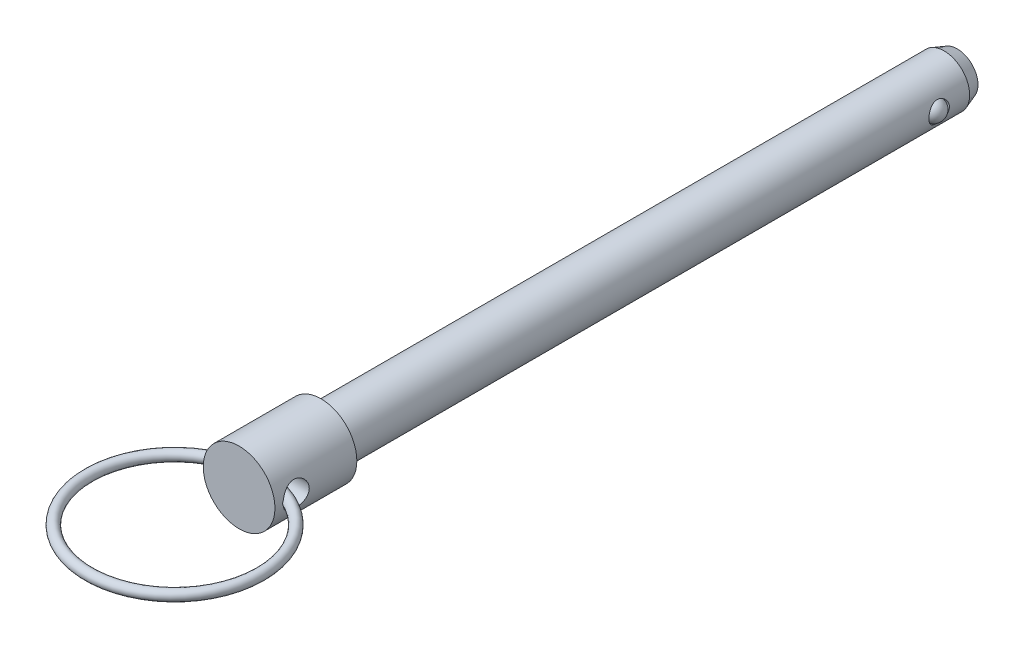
ISO-10303-21;
HEADER;
FILE_DESCRIPTION(('STEP AP214'),'2;1');
FILE_NAME('part.step','',(''),(''),'','','');
FILE_SCHEMA(('AUTOMOTIVE_DESIGN { 1 0 10303 214 1 1 1 1 }'));
ENDSEC;
DATA;
#1=APPLICATION_CONTEXT('core data for automotive mechanical design processes');
#2=APPLICATION_PROTOCOL_DEFINITION('international standard','automotive_design',2000,#1);
#3=PRODUCT_CONTEXT('',#1,'mechanical');
#4=PRODUCT('Part','Part','',(#3));
#5=PRODUCT_RELATED_PRODUCT_CATEGORY('part','',(#4));
#6=PRODUCT_DEFINITION_FORMATION('','',#4);
#7=PRODUCT_DEFINITION_CONTEXT('part definition',#1,'design');
#8=PRODUCT_DEFINITION('design','',#6,#7);
#9=PRODUCT_DEFINITION_SHAPE('','',#8);
#10=(LENGTH_UNIT() NAMED_UNIT(*) SI_UNIT(.MILLI.,.METRE.));
#11=(NAMED_UNIT(*) PLANE_ANGLE_UNIT() SI_UNIT($,.RADIAN.));
#12=(NAMED_UNIT(*) SI_UNIT($,.STERADIAN.) SOLID_ANGLE_UNIT());
#13=UNCERTAINTY_MEASURE_WITH_UNIT(LENGTH_MEASURE(1.E-05),#10,'distance_accuracy_value','');
#14=(GEOMETRIC_REPRESENTATION_CONTEXT(3) GLOBAL_UNCERTAINTY_ASSIGNED_CONTEXT((#13)) GLOBAL_UNIT_ASSIGNED_CONTEXT((#10,
#11,#12)) REPRESENTATION_CONTEXT('',''));
#15=CARTESIAN_POINT('',(0.,0.,0.));
#16=DIRECTION('',(0.,0.,1.));
#17=DIRECTION('',(1.,0.,0.));
#18=AXIS2_PLACEMENT_3D('',#15,#16,#17);
#19=CARTESIAN_POINT('',(7.9375,0.,9.398));
#20=DIRECTION('',(-1.,0.,0.));
#21=DIRECTION('',(0.,0.,-1.));
#22=AXIS2_PLACEMENT_3D('',#19,#20,#21);
#23=CYLINDRICAL_SURFACE('',#22,2.0193);
#24=CARTESIAN_POINT('',(-5.55645,0.413388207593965,11.3745329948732));
#25=CARTESIAN_POINT('',(-5.53323669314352,0.388835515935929,11.3796705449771));
#26=CARTESIAN_POINT('',(-5.51157389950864,0.362641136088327,11.3846690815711));
#27=CARTESIAN_POINT('',(-5.47216390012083,0.307044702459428,11.3940198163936));
#28=CARTESIAN_POINT('',(-5.45444977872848,0.277618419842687,11.3983664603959));
#29=CARTESIAN_POINT('',(-5.42406600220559,0.215851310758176,11.4059720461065));
#30=CARTESIAN_POINT('',(-5.41142802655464,0.183493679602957,11.4092241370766));
#31=CARTESIAN_POINT('',(-5.3923512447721,0.116986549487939,11.4141821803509));
#32=CARTESIAN_POINT('',(-5.38588919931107,0.0828442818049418,11.4158939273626));
#33=CARTESIAN_POINT('',(-5.3799561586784,0.0172985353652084,11.4174656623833));
#34=CARTESIAN_POINT('',(-5.37986165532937,-0.0140451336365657,11.4174908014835));
#35=CARTESIAN_POINT('',(-5.38511249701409,-0.0762532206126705,11.4160995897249));
#36=CARTESIAN_POINT('',(-5.39046041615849,-0.10711740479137,11.4146825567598));
#37=CARTESIAN_POINT('',(-5.40574321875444,-0.16564025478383,11.4106965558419));
#38=CARTESIAN_POINT('',(-5.41539031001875,-0.19338072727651,11.408200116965));
#39=CARTESIAN_POINT('',(-5.43862859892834,-0.247073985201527,11.4023097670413));
#40=CARTESIAN_POINT('',(-5.45222392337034,-0.27302486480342,11.398914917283));
#41=CARTESIAN_POINT('',(-5.48024922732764,-0.318737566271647,11.3920973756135));
#42=CARTESIAN_POINT('',(-5.49418727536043,-0.33882099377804,11.3887682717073));
#43=CARTESIAN_POINT('',(-5.523970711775,-0.37733037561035,11.3818282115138));
#44=CARTESIAN_POINT('',(-5.53980753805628,-0.395763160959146,11.378218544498));
#45=CARTESIAN_POINT('',(-5.55645,-0.413388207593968,11.3745329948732));
#46=B_SPLINE_CURVE_WITH_KNOTS('',3,(#24,#25,#26,#27,#28,#29,#30,#31,#32,#33,#34,#35,#36,#37,#38,
#39,#40,#41,#42,#43,#44,#45),.UNSPECIFIED.,.F.,.F.,(4,2,2,2,2,2,2,2,2,2,4),(0.,
0.102621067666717,0.206072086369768,0.310159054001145,0.413852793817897,0.507376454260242,
0.600944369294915,0.689017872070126,0.777183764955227,0.851068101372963,0.924630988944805),.UNSPECIFIED.);
#47=CARTESIAN_POINT('',(-5.54200209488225,0.397651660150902,11.3777589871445));
#48=VERTEX_POINT('',#47);
#49=CARTESIAN_POINT('',(-5.5420020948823,-0.397651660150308,11.3777589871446));
#50=VERTEX_POINT('',#49);
#51=EDGE_CURVE('E40',#48,#50,#46,.T.);
#52=ORIENTED_EDGE('',*,*,#51,.F.);
#53=CARTESIAN_POINT('',(-5.55625,0.,11.4173));
#54=CARTESIAN_POINT('',(-5.55624527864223,-0.109432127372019,11.4172937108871));
#55=CARTESIAN_POINT('',(-5.55298237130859,-0.218969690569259,11.408361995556));
#56=CARTESIAN_POINT('',(-5.54026368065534,-0.434902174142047,11.372953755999));
#57=CARTESIAN_POINT('',(-5.53079819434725,-0.54129189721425,11.3464497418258));
#58=CARTESIAN_POINT('',(-5.50670156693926,-0.747605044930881,11.2769560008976));
#59=CARTESIAN_POINT('',(-5.49208344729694,-0.847544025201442,11.2340078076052));
#60=CARTESIAN_POINT('',(-5.45915039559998,-1.03875753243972,11.1330083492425));
#61=CARTESIAN_POINT('',(-5.44083572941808,-1.13003268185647,11.0749581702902));
#62=CARTESIAN_POINT('',(-5.4015811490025,-1.30505728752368,10.9429422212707));
#63=CARTESIAN_POINT('',(-5.38056990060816,-1.38841141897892,10.8684736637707));
#64=CARTESIAN_POINT('',(-5.33865236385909,-1.54176439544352,10.7067995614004));
#65=CARTESIAN_POINT('',(-5.31774611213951,-1.61175885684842,10.6195898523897));
#66=CARTESIAN_POINT('',(-5.27759352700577,-1.73882919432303,10.4311528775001));
#67=CARTESIAN_POINT('',(-5.25843183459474,-1.79536185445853,10.3295394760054));
#68=CARTESIAN_POINT('',(-5.22503611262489,-1.89036141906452,10.1174402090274));
#69=CARTESIAN_POINT('',(-5.21080023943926,-1.92883508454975,10.0069576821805));
#70=CARTESIAN_POINT('',(-5.18962447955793,-1.98509166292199,9.78477737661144));
#71=CARTESIAN_POINT('',(-5.18242178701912,-2.00362275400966,9.67329490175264));
#72=CARTESIAN_POINT('',(-5.17535625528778,-2.02180769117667,9.44858805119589));
#73=CARTESIAN_POINT('',(-5.17549061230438,-2.02146874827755,9.33536435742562));
#74=CARTESIAN_POINT('',(-5.18285629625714,-2.00249790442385,9.11709454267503));
#75=CARTESIAN_POINT('',(-5.18969215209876,-1.98488533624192,9.01194405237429));
#76=CARTESIAN_POINT('',(-5.20903632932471,-1.93354575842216,8.80620743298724));
#77=CARTESIAN_POINT('',(-5.22154547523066,-1.89981640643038,8.70562196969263));
#78=CARTESIAN_POINT('',(-5.25107746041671,-1.81661001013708,8.50972358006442));
#79=CARTESIAN_POINT('',(-5.26817827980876,-1.76685762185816,8.41453987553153));
#80=CARTESIAN_POINT('',(-5.30493780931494,-1.65321144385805,8.23357336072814));
#81=CARTESIAN_POINT('',(-5.32459724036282,-1.58931366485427,8.14779321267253));
#82=CARTESIAN_POINT('',(-5.36576425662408,-1.44447059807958,7.98240722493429));
#83=CARTESIAN_POINT('',(-5.38731044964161,-1.36270785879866,7.90352531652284));
#84=CARTESIAN_POINT('',(-5.42876622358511,-1.18682967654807,7.76035905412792));
#85=CARTESIAN_POINT('',(-5.44867505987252,-1.09270866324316,7.69608131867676));
#86=CARTESIAN_POINT('',(-5.48497084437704,-0.893001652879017,7.58320896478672));
#87=CARTESIAN_POINT('',(-5.5013029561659,-0.78727009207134,7.53485348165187));
#88=CARTESIAN_POINT('',(-5.52817729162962,-0.568540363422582,7.4569293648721));
#89=CARTESIAN_POINT('',(-5.53873126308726,-0.455557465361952,7.42732259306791));
#90=CARTESIAN_POINT('',(-5.54924569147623,-0.284581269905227,7.39803699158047));
#91=CARTESIAN_POINT('',(-5.55186369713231,-0.227949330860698,7.3907957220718));
#92=CARTESIAN_POINT('',(-5.55536708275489,-0.114221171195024,7.3811255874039));
#93=CARTESIAN_POINT('',(-5.55625246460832,-0.0571249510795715,7.37869671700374));
#94=CARTESIAN_POINT('',(-5.55624527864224,0.109432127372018,7.37870628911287));
#95=CARTESIAN_POINT('',(-5.55298237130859,0.218969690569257,7.38763800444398));
#96=CARTESIAN_POINT('',(-5.54026368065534,0.434902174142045,7.42304624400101));
#97=CARTESIAN_POINT('',(-5.53079819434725,0.541291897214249,7.44955025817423));
#98=CARTESIAN_POINT('',(-5.50670156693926,0.747605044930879,7.51904399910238));
#99=CARTESIAN_POINT('',(-5.49208344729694,0.847544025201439,7.56199219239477));
#100=CARTESIAN_POINT('',(-5.45915039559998,1.03875753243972,7.66299165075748));
#101=CARTESIAN_POINT('',(-5.44083572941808,1.13003268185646,7.72104182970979));
#102=CARTESIAN_POINT('',(-5.4015811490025,1.30505728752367,7.85305777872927));
#103=CARTESIAN_POINT('',(-5.38056990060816,1.38841141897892,7.92752633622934));
#104=CARTESIAN_POINT('',(-5.33865236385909,1.54176439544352,8.08920043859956));
#105=CARTESIAN_POINT('',(-5.31774611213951,1.61175885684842,8.17641014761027));
#106=CARTESIAN_POINT('',(-5.27759352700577,1.73882919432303,8.36484712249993));
#107=CARTESIAN_POINT('',(-5.25843183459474,1.79536185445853,8.46646052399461));
#108=CARTESIAN_POINT('',(-5.22503611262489,1.89036141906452,8.67855979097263));
#109=CARTESIAN_POINT('',(-5.21080023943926,1.92883508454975,8.78904231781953));
#110=CARTESIAN_POINT('',(-5.18962447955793,1.98509166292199,9.01122262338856));
#111=CARTESIAN_POINT('',(-5.18242178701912,2.00362275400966,9.12270509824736));
#112=CARTESIAN_POINT('',(-5.17535625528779,2.02180769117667,9.34741194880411));
#113=CARTESIAN_POINT('',(-5.17549061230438,2.02146874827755,9.46063564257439));
#114=CARTESIAN_POINT('',(-5.18285629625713,2.00249790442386,9.67890545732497));
#115=CARTESIAN_POINT('',(-5.18969215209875,1.98488533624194,9.78405594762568));
#116=CARTESIAN_POINT('',(-5.20903632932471,1.93354575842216,9.98979256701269));
#117=CARTESIAN_POINT('',(-5.22154547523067,1.89981640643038,10.0903780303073));
#118=CARTESIAN_POINT('',(-5.25107746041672,1.81661001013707,10.2862764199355));
#119=CARTESIAN_POINT('',(-5.26817827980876,1.76685762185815,10.3814601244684));
#120=CARTESIAN_POINT('',(-5.30493780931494,1.65321144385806,10.5624266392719));
#121=CARTESIAN_POINT('',(-5.32459724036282,1.58931366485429,10.6482067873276));
#122=CARTESIAN_POINT('',(-5.36576425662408,1.44447059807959,10.8135927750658));
#123=CARTESIAN_POINT('',(-5.38731044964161,1.36270785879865,10.8924746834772));
#124=CARTESIAN_POINT('',(-5.42876622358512,1.18682967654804,11.0356409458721));
#125=CARTESIAN_POINT('',(-5.44867505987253,1.09270866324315,11.0999186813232));
#126=CARTESIAN_POINT('',(-5.48497084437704,0.893001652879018,11.2127910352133));
#127=CARTESIAN_POINT('',(-5.5013029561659,0.787270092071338,11.2611465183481));
#128=CARTESIAN_POINT('',(-5.52817729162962,0.56854036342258,11.3390706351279));
#129=CARTESIAN_POINT('',(-5.53873126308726,0.455557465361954,11.3686774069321));
#130=CARTESIAN_POINT('',(-5.54924569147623,0.28458126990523,11.3979630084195));
#131=CARTESIAN_POINT('',(-5.55186369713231,0.2279493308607,11.4052042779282));
#132=CARTESIAN_POINT('',(-5.5553670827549,0.114221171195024,11.4148744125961));
#133=CARTESIAN_POINT('',(-5.55625246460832,0.057124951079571,11.4173032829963));
#134=CARTESIAN_POINT('',(-5.55625,0.,11.4173));
#135=B_SPLINE_CURVE_WITH_KNOTS('',3,(#53,#54,#55,#56,#57,#58,#59,#60,#61,#62,#63,#64,#65,#66,
#67,#68,#69,#70,#71,#72,#73,#74,#75,#76,#77,#78,#79,#80,#81,#82,#83,#84,#85,#86,#87,#88,#89,#90,
#91,#92,#93,#94,#95,#96,#97,#98,#99,#100,#101,#102,#103,#104,#105,#106,#107,#108,#109,#110,#111,
#112,#113,#114,#115,#116,#117,#118,#119,#120,#121,#122,#123,#124,#125,#126,#127,#128,#129,#130,
#131,#132,#133,#134),.UNSPECIFIED.,.T.,.F.,(4,2,2,2,2,2,2,2,2,2,2,2,2,2,2,2,2,2,2,2,2,2,2,2,2,2,
2,2,2,2,2,2,2,2,2,2,2,2,2,2,4),(0.,0.328075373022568,0.656665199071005,0.984430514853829,
1.31217226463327,1.65185430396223,1.99164760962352,2.3434350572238,2.69509069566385,
3.03303658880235,3.3708533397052,3.68986542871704,4.00892389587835,4.33378721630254,
4.65874227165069,5.00406386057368,5.34954163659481,5.69999369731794,6.04973056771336,
6.22099023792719,6.39224972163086,6.72032509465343,7.04891492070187,7.37668023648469,
7.70442198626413,8.04410402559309,8.38389733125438,8.73568477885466,9.08734041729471,
9.42528631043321,9.76310306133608,10.0821151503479,10.4011736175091,10.7260369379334,
11.0509919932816,11.3963135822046,11.7417913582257,12.0922434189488,12.4419802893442,
12.6132399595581,12.7844994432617),.UNSPECIFIED.);
#136=EDGE_CURVE('E66',#50,#48,#135,.T.);
#137=ORIENTED_EDGE('',*,*,#136,.F.);
#138=EDGE_LOOP('',(#52,#137));
#139=FACE_BOUND('',#138,.T.);
#140=CARTESIAN_POINT('',(5.55645,-0.41338820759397,11.3745329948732));
#141=CARTESIAN_POINT('',(5.53323669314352,-0.388835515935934,11.3796705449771));
#142=CARTESIAN_POINT('',(5.51157389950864,-0.362641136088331,11.3846690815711));
#143=CARTESIAN_POINT('',(5.47216390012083,-0.307044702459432,11.3940198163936));
#144=CARTESIAN_POINT('',(5.45444977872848,-0.277618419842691,11.3983664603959));
#145=CARTESIAN_POINT('',(5.42406600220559,-0.215851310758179,11.4059720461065));
#146=CARTESIAN_POINT('',(5.41142802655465,-0.183493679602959,11.4092241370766));
#147=CARTESIAN_POINT('',(5.3923512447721,-0.116986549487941,11.4141821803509));
#148=CARTESIAN_POINT('',(5.38588919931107,-0.0828442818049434,11.4158939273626));
#149=CARTESIAN_POINT('',(5.3799561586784,-0.0172985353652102,11.4174656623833));
#150=CARTESIAN_POINT('',(5.37986165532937,0.0140451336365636,11.4174908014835));
#151=CARTESIAN_POINT('',(5.38511249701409,0.0762532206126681,11.4160995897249));
#152=CARTESIAN_POINT('',(5.39046041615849,0.107117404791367,11.4146825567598));
#153=CARTESIAN_POINT('',(5.40574321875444,0.165640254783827,11.4106965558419));
#154=CARTESIAN_POINT('',(5.41539031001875,0.193380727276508,11.408200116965));
#155=CARTESIAN_POINT('',(5.43862859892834,0.247073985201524,11.4023097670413));
#156=CARTESIAN_POINT('',(5.45222392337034,0.273024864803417,11.398914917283));
#157=CARTESIAN_POINT('',(5.48024922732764,0.318737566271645,11.3920973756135));
#158=CARTESIAN_POINT('',(5.49418727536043,0.338820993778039,11.3887682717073));
#159=CARTESIAN_POINT('',(5.523970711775,0.37733037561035,11.3818282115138));
#160=CARTESIAN_POINT('',(5.53980753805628,0.395763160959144,11.378218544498));
#161=CARTESIAN_POINT('',(5.55645,0.413388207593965,11.3745329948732));
#162=B_SPLINE_CURVE_WITH_KNOTS('',3,(#140,#141,#142,#143,#144,#145,#146,#147,#148,#149,#150,
#151,#152,#153,#154,#155,#156,#157,#158,#159,#160,#161),.UNSPECIFIED.,.F.,.F.,(4,2,2,2,2,2,2,2,
2,2,4),(0.,0.102621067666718,0.206072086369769,0.310159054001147,0.4138527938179,
0.507376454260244,0.600944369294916,0.689017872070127,0.777183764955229,0.851068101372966,
0.924630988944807),.UNSPECIFIED.);
#163=CARTESIAN_POINT('',(5.54200209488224,-0.397651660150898,11.3777589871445));
#164=VERTEX_POINT('',#163);
#165=CARTESIAN_POINT('',(5.54200209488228,0.397651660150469,11.3777589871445));
#166=VERTEX_POINT('',#165);
#167=EDGE_CURVE('E33',#164,#166,#162,.T.);
#168=ORIENTED_EDGE('',*,*,#167,.F.);
#169=CARTESIAN_POINT('',(5.55625,0.,7.3787));
#170=CARTESIAN_POINT('',(5.55624527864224,-0.109432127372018,7.37870628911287));
#171=CARTESIAN_POINT('',(5.55298237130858,-0.218969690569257,7.38763800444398));
#172=CARTESIAN_POINT('',(5.54026368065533,-0.434902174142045,7.42304624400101));
#173=CARTESIAN_POINT('',(5.53079819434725,-0.541291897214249,7.44955025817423));
#174=CARTESIAN_POINT('',(5.50670156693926,-0.747605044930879,7.51904399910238));
#175=CARTESIAN_POINT('',(5.49208344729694,-0.847544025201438,7.56199219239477));
#176=CARTESIAN_POINT('',(5.45915039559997,-1.03875753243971,7.66299165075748));
#177=CARTESIAN_POINT('',(5.44083572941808,-1.13003268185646,7.72104182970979));
#178=CARTESIAN_POINT('',(5.4015811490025,-1.30505728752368,7.85305777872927));
#179=CARTESIAN_POINT('',(5.38056990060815,-1.38841141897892,7.92752633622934));
#180=CARTESIAN_POINT('',(5.33865236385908,-1.54176439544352,8.08920043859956));
#181=CARTESIAN_POINT('',(5.31774611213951,-1.61175885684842,8.17641014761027));
#182=CARTESIAN_POINT('',(5.27759352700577,-1.73882919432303,8.36484712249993));
#183=CARTESIAN_POINT('',(5.25843183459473,-1.79536185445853,8.46646052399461));
#184=CARTESIAN_POINT('',(5.22503611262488,-1.89036141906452,8.67855979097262));
#185=CARTESIAN_POINT('',(5.21080023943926,-1.92883508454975,8.78904231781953));
#186=CARTESIAN_POINT('',(5.18962447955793,-1.98509166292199,9.01122262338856));
#187=CARTESIAN_POINT('',(5.18242178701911,-2.00362275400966,9.12270509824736));
#188=CARTESIAN_POINT('',(5.17535625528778,-2.02180769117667,9.34741194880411));
#189=CARTESIAN_POINT('',(5.17549061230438,-2.02146874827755,9.46063564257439));
#190=CARTESIAN_POINT('',(5.18285629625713,-2.00249790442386,9.67890545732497));
#191=CARTESIAN_POINT('',(5.18969215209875,-1.98488533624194,9.78405594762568));
#192=CARTESIAN_POINT('',(5.2090363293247,-1.93354575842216,9.98979256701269));
#193=CARTESIAN_POINT('',(5.22154547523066,-1.89981640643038,10.0903780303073));
#194=CARTESIAN_POINT('',(5.25107746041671,-1.81661001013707,10.2862764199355));
#195=CARTESIAN_POINT('',(5.26817827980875,-1.76685762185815,10.3814601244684));
#196=CARTESIAN_POINT('',(5.30493780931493,-1.65321144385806,10.5624266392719));
#197=CARTESIAN_POINT('',(5.32459724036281,-1.58931366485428,10.6482067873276));
#198=CARTESIAN_POINT('',(5.36576425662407,-1.44447059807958,10.8135927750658));
#199=CARTESIAN_POINT('',(5.3873104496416,-1.36270785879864,10.8924746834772));
#200=CARTESIAN_POINT('',(5.42876622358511,-1.18682967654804,11.0356409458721));
#201=CARTESIAN_POINT('',(5.44867505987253,-1.09270866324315,11.0999186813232));
#202=CARTESIAN_POINT('',(5.48497084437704,-0.893001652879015,11.2127910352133));
#203=CARTESIAN_POINT('',(5.50130295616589,-0.787270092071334,11.2611465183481));
#204=CARTESIAN_POINT('',(5.52817729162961,-0.568540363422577,11.3390706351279));
#205=CARTESIAN_POINT('',(5.53873126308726,-0.455557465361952,11.3686774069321));
#206=CARTESIAN_POINT('',(5.54924569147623,-0.284581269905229,11.3979630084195));
#207=CARTESIAN_POINT('',(5.5518636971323,-0.227949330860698,11.4052042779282));
#208=CARTESIAN_POINT('',(5.55536708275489,-0.114221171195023,11.4148744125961));
#209=CARTESIAN_POINT('',(5.55625246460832,-0.0571249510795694,11.4173032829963));
#210=CARTESIAN_POINT('',(5.55624527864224,0.10943212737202,11.4172937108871));
#211=CARTESIAN_POINT('',(5.55298237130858,0.21896969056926,11.408361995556));
#212=CARTESIAN_POINT('',(5.54026368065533,0.434902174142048,11.372953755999));
#213=CARTESIAN_POINT('',(5.53079819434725,0.541291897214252,11.3464497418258));
#214=CARTESIAN_POINT('',(5.50670156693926,0.74760504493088,11.2769560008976));
#215=CARTESIAN_POINT('',(5.49208344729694,0.847544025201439,11.2340078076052));
#216=CARTESIAN_POINT('',(5.45915039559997,1.03875753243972,11.1330083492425));
#217=CARTESIAN_POINT('',(5.44083572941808,1.13003268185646,11.0749581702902));
#218=CARTESIAN_POINT('',(5.4015811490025,1.30505728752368,10.9429422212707));
#219=CARTESIAN_POINT('',(5.38056990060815,1.38841141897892,10.8684736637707));
#220=CARTESIAN_POINT('',(5.33865236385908,1.54176439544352,10.7067995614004));
#221=CARTESIAN_POINT('',(5.31774611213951,1.61175885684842,10.6195898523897));
#222=CARTESIAN_POINT('',(5.27759352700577,1.73882919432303,10.4311528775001));
#223=CARTESIAN_POINT('',(5.25843183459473,1.79536185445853,10.3295394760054));
#224=CARTESIAN_POINT('',(5.22503611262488,1.89036141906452,10.1174402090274));
#225=CARTESIAN_POINT('',(5.21080023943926,1.92883508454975,10.0069576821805));
#226=CARTESIAN_POINT('',(5.18962447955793,1.98509166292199,9.78477737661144));
#227=CARTESIAN_POINT('',(5.18242178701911,2.00362275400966,9.67329490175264));
#228=CARTESIAN_POINT('',(5.17535625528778,2.02180769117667,9.44858805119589));
#229=CARTESIAN_POINT('',(5.17549061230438,2.02146874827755,9.33536435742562));
#230=CARTESIAN_POINT('',(5.18285629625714,2.00249790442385,9.11709454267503));
#231=CARTESIAN_POINT('',(5.18969215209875,1.98488533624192,9.01194405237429));
#232=CARTESIAN_POINT('',(5.2090363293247,1.93354575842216,8.80620743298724));
#233=CARTESIAN_POINT('',(5.22154547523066,1.89981640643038,8.70562196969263));
#234=CARTESIAN_POINT('',(5.25107746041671,1.81661001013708,8.50972358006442));
#235=CARTESIAN_POINT('',(5.26817827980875,1.76685762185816,8.41453987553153));
#236=CARTESIAN_POINT('',(5.30493780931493,1.65321144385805,8.23357336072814));
#237=CARTESIAN_POINT('',(5.32459724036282,1.58931366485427,8.14779321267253));
#238=CARTESIAN_POINT('',(5.36576425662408,1.44447059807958,7.98240722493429));
#239=CARTESIAN_POINT('',(5.3873104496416,1.36270785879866,7.90352531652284));
#240=CARTESIAN_POINT('',(5.4287662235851,1.18682967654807,7.76035905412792));
#241=CARTESIAN_POINT('',(5.44867505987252,1.09270866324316,7.69608131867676));
#242=CARTESIAN_POINT('',(5.48497084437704,0.893001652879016,7.58320896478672));
#243=CARTESIAN_POINT('',(5.50130295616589,0.787270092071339,7.53485348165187));
#244=CARTESIAN_POINT('',(5.52817729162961,0.56854036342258,7.4569293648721));
#245=CARTESIAN_POINT('',(5.53873126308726,0.455557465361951,7.42732259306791));
#246=CARTESIAN_POINT('',(5.54924569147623,0.284581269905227,7.39803699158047));
#247=CARTESIAN_POINT('',(5.5518636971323,0.227949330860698,7.3907957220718));
#248=CARTESIAN_POINT('',(5.55536708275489,0.114221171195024,7.3811255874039));
#249=CARTESIAN_POINT('',(5.55625246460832,0.0571249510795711,7.37869671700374));
#250=CARTESIAN_POINT('',(5.55625,0.,7.3787));
#251=B_SPLINE_CURVE_WITH_KNOTS('',3,(#169,#170,#171,#172,#173,#174,#175,#176,#177,#178,#179,
#180,#181,#182,#183,#184,#185,#186,#187,#188,#189,#190,#191,#192,#193,#194,#195,#196,#197,#198,
#199,#200,#201,#202,#203,#204,#205,#206,#207,#208,#209,#210,#211,#212,#213,#214,#215,#216,#217,
#218,#219,#220,#221,#222,#223,#224,#225,#226,#227,#228,#229,#230,#231,#232,#233,#234,#235,#236,
#237,#238,#239,#240,#241,#242,#243,#244,#245,#246,#247,#248,#249,#250),.UNSPECIFIED.,.T.,.F.,(4,
2,2,2,2,2,2,2,2,2,2,2,2,2,2,2,2,2,2,2,2,2,2,2,2,2,2,2,2,2,2,2,2,2,2,2,2,2,2,2,4),(0.,
0.328075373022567,0.656665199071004,0.984430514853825,1.31217226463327,1.65185430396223,
1.99164760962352,2.3434350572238,2.69509069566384,3.03303658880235,3.37085333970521,
3.68986542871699,4.00892389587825,4.33378721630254,4.65874227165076,5.00406386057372,
5.34954163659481,5.69999369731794,6.04973056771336,6.2209902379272,6.39224972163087,
6.72032509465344,7.04891492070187,7.37668023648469,7.70442198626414,8.0441040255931,
8.38389733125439,8.73568477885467,9.08734041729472,9.42528631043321,9.76310306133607,
10.0821151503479,10.4011736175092,10.7260369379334,11.0509919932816,11.3963135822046,
11.7417913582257,12.0922434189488,12.4419802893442,12.6132399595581,12.7844994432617),.UNSPECIFIED.);
#252=EDGE_CURVE('E62',#166,#164,#251,.T.);
#253=ORIENTED_EDGE('',*,*,#252,.F.);
#254=EDGE_LOOP('',(#168,#253));
#255=FACE_BOUND('',#254,.T.);
#256=ADVANCED_FACE('F14',(#139,#255),#23,.F.);
#257=CARTESIAN_POINT('',(0.,0.,-28.63596));
#258=DIRECTION('',(0.,0.,-1.));
#259=DIRECTION('',(1.,0.,0.));
#260=AXIS2_PLACEMENT_3D('',#257,#258,#259);
#261=CYLINDRICAL_SURFACE('',#260,5.55625);
#262=ORIENTED_EDGE('',*,*,#252,.T.);
#263=CARTESIAN_POINT('',(5.54421787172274,-0.365461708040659,9.83190663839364));
#264=CARTESIAN_POINT('',(5.54159927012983,-0.405183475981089,9.85299237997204));
#265=CARTESIAN_POINT('',(5.53866943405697,-0.443081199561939,9.87751774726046));
#266=CARTESIAN_POINT('',(5.53252642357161,-0.514143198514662,9.93266317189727));
#267=CARTESIAN_POINT('',(5.52931303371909,-0.547303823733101,9.96328788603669));
#268=CARTESIAN_POINT('',(5.52297121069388,-0.60797502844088,10.0295890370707));
#269=CARTESIAN_POINT('',(5.51984262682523,-0.635496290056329,10.0652557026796));
#270=CARTESIAN_POINT('',(5.51399436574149,-0.68438911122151,10.1405913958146));
#271=CARTESIAN_POINT('',(5.51127466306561,-0.705761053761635,10.1802601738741));
#272=CARTESIAN_POINT('',(5.50642474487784,-0.742671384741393,10.2638892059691));
#273=CARTESIAN_POINT('',(5.50431797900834,-0.757984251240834,10.3079500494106));
#274=CARTESIAN_POINT('',(5.50101204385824,-0.781615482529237,10.3979361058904));
#275=CARTESIAN_POINT('',(5.49981316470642,-0.789931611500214,10.443861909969));
#276=CARTESIAN_POINT('',(5.49835353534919,-0.800032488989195,10.539900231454));
#277=CARTESIAN_POINT('',(5.49816933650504,-0.801284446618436,10.5900697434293));
#278=CARTESIAN_POINT('',(5.49892147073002,-0.796104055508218,10.6900002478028));
#279=CARTESIAN_POINT('',(5.49985823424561,-0.789668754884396,10.7397610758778));
#280=CARTESIAN_POINT('',(5.50284107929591,-0.768620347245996,10.8417110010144));
#281=CARTESIAN_POINT('',(5.50497087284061,-0.753387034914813,10.8937702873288));
#282=CARTESIAN_POINT('',(5.51012438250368,-0.71471812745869,10.9947435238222));
#283=CARTESIAN_POINT('',(5.51314873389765,-0.691276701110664,11.0436552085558));
#284=CARTESIAN_POINT('',(5.51983464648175,-0.63572546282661,11.1383225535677));
#285=CARTESIAN_POINT('',(5.52351302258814,-0.60336997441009,11.18393381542));
#286=CARTESIAN_POINT('',(5.53095411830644,-0.530831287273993,11.2684220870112));
#287=CARTESIAN_POINT('',(5.53471671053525,-0.490659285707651,11.3073085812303));
#288=CARTESIAN_POINT('',(5.54091648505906,-0.413839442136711,11.3679116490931));
#289=CARTESIAN_POINT('',(5.54345448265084,-0.378677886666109,11.3915073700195));
#290=CARTESIAN_POINT('',(5.54800040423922,-0.304904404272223,11.4325750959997));
#291=CARTESIAN_POINT('',(5.55000873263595,-0.266295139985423,11.4500517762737));
#292=CARTESIAN_POINT('',(5.55327017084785,-0.18631270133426,11.4779870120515));
#293=CARTESIAN_POINT('',(5.55451894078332,-0.144925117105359,11.4884052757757));
#294=CARTESIAN_POINT('',(5.55607451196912,-0.0609131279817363,11.501336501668));
#295=CARTESIAN_POINT('',(5.55638174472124,-0.0182892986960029,11.5038530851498));
#296=CARTESIAN_POINT('',(5.55603111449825,0.0624826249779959,11.5009567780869));
#297=CARTESIAN_POINT('',(5.55546478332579,0.100660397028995,11.4962960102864));
#298=CARTESIAN_POINT('',(5.55359870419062,0.175681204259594,11.4806908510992));
#299=CARTESIAN_POINT('',(5.55229894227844,0.212524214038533,11.469746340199));
#300=CARTESIAN_POINT('',(5.54909692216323,0.284130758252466,11.4421008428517));
#301=CARTESIAN_POINT('',(5.5471918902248,0.318883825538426,11.4253733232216));
#302=CARTESIAN_POINT('',(5.54296322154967,0.385471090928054,11.3869302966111));
#303=CARTESIAN_POINT('',(5.54063944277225,0.417304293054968,11.3652130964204));
#304=CARTESIAN_POINT('',(5.5354829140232,0.481129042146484,11.3147874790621));
#305=CARTESIAN_POINT('',(5.53262240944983,0.512706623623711,11.2855592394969));
#306=CARTESIAN_POINT('',(5.5268796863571,0.571299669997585,11.2228494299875));
#307=CARTESIAN_POINT('',(5.52399745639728,0.598312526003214,11.1893654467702));
#308=CARTESIAN_POINT('',(5.51801859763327,0.651308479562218,11.1136059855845));
#309=CARTESIAN_POINT('',(5.5149570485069,0.676495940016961,11.0707701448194));
#310=CARTESIAN_POINT('',(5.50942501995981,0.720163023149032,10.9817637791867));
#311=CARTESIAN_POINT('',(5.50695488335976,0.738638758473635,10.9355913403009));
#312=CARTESIAN_POINT('',(5.50263850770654,0.770172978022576,10.8359152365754));
#313=CARTESIAN_POINT('',(5.50088711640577,0.782441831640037,10.78215533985));
#314=CARTESIAN_POINT('',(5.49866174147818,0.797931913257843,10.6733049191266));
#315=CARTESIAN_POINT('',(5.49818796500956,0.801151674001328,10.6182141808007));
#316=CARTESIAN_POINT('',(5.49863033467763,0.798111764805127,10.5080372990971));
#317=CARTESIAN_POINT('',(5.49955247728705,0.791811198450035,10.4529521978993));
#318=CARTESIAN_POINT('',(5.50273643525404,0.769372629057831,10.3448543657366));
#319=CARTESIAN_POINT('',(5.5049975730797,0.75323960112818,10.2918406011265));
#320=CARTESIAN_POINT('',(5.51037511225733,0.712783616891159,10.1937092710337));
#321=CARTESIAN_POINT('',(5.5134147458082,0.689164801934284,10.1482976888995));
#322=CARTESIAN_POINT('',(5.52002982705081,0.633996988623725,10.0626181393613));
#323=CARTESIAN_POINT('',(5.52360498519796,0.602452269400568,10.0223474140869));
#324=CARTESIAN_POINT('',(5.53050798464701,0.535199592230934,9.95157040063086));
#325=CARTESIAN_POINT('',(5.53383191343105,0.500049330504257,9.92053279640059));
#326=CARTESIAN_POINT('',(5.54011700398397,0.42478126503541,9.86516962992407));
#327=CARTESIAN_POINT('',(5.54307828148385,0.384665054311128,9.84084192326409));
#328=CARTESIAN_POINT('',(5.54813855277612,0.302772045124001,9.80075188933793));
#329=CARTESIAN_POINT('',(5.55027289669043,0.261174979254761,9.78462601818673));
#330=CARTESIAN_POINT('',(5.5536321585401,0.175801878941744,9.75969167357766));
#331=CARTESIAN_POINT('',(5.55485708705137,0.132025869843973,9.75088311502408));
#332=CARTESIAN_POINT('',(5.55624112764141,0.0444774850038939,9.74095514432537));
#333=CARTESIAN_POINT('',(5.55642085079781,0.000722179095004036,9.7396870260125));
#334=CARTESIAN_POINT('',(5.55574919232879,-0.0863562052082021,9.74448109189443));
#335=CARTESIAN_POINT('',(5.55489852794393,-0.129679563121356,9.75053817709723));
#336=CARTESIAN_POINT('',(5.55253965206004,-0.205803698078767,9.7677777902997));
#337=CARTESIAN_POINT('',(5.55120514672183,-0.238917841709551,9.77763116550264));
#338=CARTESIAN_POINT('',(5.54804727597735,-0.303532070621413,9.80161898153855));
#339=CARTESIAN_POINT('',(5.54622389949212,-0.335032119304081,9.81575351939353));
#340=CARTESIAN_POINT('',(5.54421787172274,-0.365461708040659,9.83190663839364));
#341=B_SPLINE_CURVE_WITH_KNOTS('',3,(#263,#264,#265,#266,#267,#268,#269,#270,#271,#272,#273,
#274,#275,#276,#277,#278,#279,#280,#281,#282,#283,#284,#285,#286,#287,#288,#289,#290,#291,#292,
#293,#294,#295,#296,#297,#298,#299,#300,#301,#302,#303,#304,#305,#306,#307,#308,#309,#310,#311,
#312,#313,#314,#315,#316,#317,#318,#319,#320,#321,#322,#323,#324,#325,#326,#327,#328,#329,#330,
#331,#332,#333,#334,#335,#336,#337,#338,#339,#340),.UNSPECIFIED.,.T.,.F.,(4,2,2,2,2,2,2,2,2,2,2,
2,2,2,2,2,2,2,2,2,2,2,2,2,2,2,2,2,2,2,2,2,2,2,2,2,2,2,4),(0.,0.135013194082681,
0.270129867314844,0.404988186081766,0.539838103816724,0.679318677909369,0.818843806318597,
0.968764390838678,1.11874256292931,1.28086949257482,1.44311183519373,1.6103720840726,
1.7773944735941,1.9041393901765,2.03078725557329,2.15815211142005,2.28545858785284,
2.40030266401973,2.51514892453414,2.63052926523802,2.74594881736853,2.87482054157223,
3.00376567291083,3.15251889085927,3.30135812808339,3.4660986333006,3.6308658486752,
3.79634286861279,3.96173622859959,4.1147383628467,4.26765806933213,4.40796960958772,
4.54823625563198,4.6815786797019,4.81491955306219,4.94562183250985,5.07623318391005,
5.17966017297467,5.28308950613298),.UNSPECIFIED.);
#342=EDGE_CURVE('E27',#164,#166,#341,.T.);
#343=ORIENTED_EDGE('',*,*,#342,.T.);
#344=EDGE_LOOP('',(#262,#343));
#345=FACE_BOUND('',#344,.T.);
#346=CARTESIAN_POINT('',(0.,0.,-8.27046764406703E-11));
#347=DIRECTION('',(0.,0.,-1.));
#348=DIRECTION('',(1.,0.,0.));
#349=AXIS2_PLACEMENT_3D('',#346,#347,#348);
#350=CIRCLE('',#349,5.55625000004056);
#351=CARTESIAN_POINT('',(5.55625000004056,0.,-8.2704921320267E-11));
#352=VERTEX_POINT('',#351);
#353=EDGE_CURVE('E70',#352,#352,#350,.T.);
#354=ORIENTED_EDGE('',*,*,#353,.F.);
#355=EDGE_LOOP('',(#354));
#356=FACE_BOUND('',#355,.T.);
#357=CARTESIAN_POINT('',(0.,0.,12.7000000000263));
#358=DIRECTION('',(0.,0.,-1.));
#359=DIRECTION('',(1.,0.,0.));
#360=AXIS2_PLACEMENT_3D('',#357,#358,#359);
#361=CIRCLE('',#360,5.55625000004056);
#362=CARTESIAN_POINT('',(5.55625000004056,0.,12.7000000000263));
#363=VERTEX_POINT('',#362);
#364=EDGE_CURVE('E60',#363,#363,#361,.T.);
#365=ORIENTED_EDGE('',*,*,#364,.T.);
#366=EDGE_LOOP('',(#365));
#367=FACE_BOUND('',#366,.T.);
#368=ORIENTED_EDGE('',*,*,#136,.T.);
#369=CARTESIAN_POINT('',(-5.54421787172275,-0.365461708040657,9.83190663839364));
#370=CARTESIAN_POINT('',(-5.54674897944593,-0.327059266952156,9.81152357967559));
#371=CARTESIAN_POINT('',(-5.54899046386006,-0.286929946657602,9.79434384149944));
#372=CARTESIAN_POINT('',(-5.55264573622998,-0.204323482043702,9.76690733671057));
#373=CARTESIAN_POINT('',(-5.55405930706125,-0.161845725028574,9.7566523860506));
#374=CARTESIAN_POINT('',(-5.55590047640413,-0.0757460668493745,9.74337399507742));
#375=CARTESIAN_POINT('',(-5.5563279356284,-0.0321240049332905,9.74035157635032));
#376=CARTESIAN_POINT('',(-5.55614850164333,0.0550080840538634,9.74163080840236));
#377=CARTESIAN_POINT('',(-5.55554166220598,0.0985181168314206,9.74593207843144));
#378=CARTESIAN_POINT('',(-5.55336559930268,0.184034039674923,9.76170297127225));
#379=CARTESIAN_POINT('',(-5.55179977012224,0.226044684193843,9.77314731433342));
#380=CARTESIAN_POINT('',(-5.54788216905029,0.307544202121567,9.80284367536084));
#381=CARTESIAN_POINT('',(-5.54553040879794,0.347033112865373,9.82109559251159));
#382=CARTESIAN_POINT('',(-5.54028406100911,0.422625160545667,9.86398459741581));
#383=CARTESIAN_POINT('',(-5.53738652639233,0.458708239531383,9.88865664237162));
#384=CARTESIAN_POINT('',(-5.53137181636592,0.526301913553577,9.94359369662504));
#385=CARTESIAN_POINT('',(-5.5282546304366,0.557812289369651,9.9738589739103));
#386=CARTESIAN_POINT('',(-5.5220620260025,0.616137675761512,10.0397779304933));
#387=CARTESIAN_POINT('',(-5.51898888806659,0.642839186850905,10.075532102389));
#388=CARTESIAN_POINT('',(-5.51326962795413,0.690175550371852,10.1508758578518));
#389=CARTESIAN_POINT('',(-5.51062357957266,0.710809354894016,10.1904661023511));
#390=CARTESIAN_POINT('',(-5.50589976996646,0.746541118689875,10.2743009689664));
#391=CARTESIAN_POINT('',(-5.50385436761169,0.761335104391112,10.3186766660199));
#392=CARTESIAN_POINT('',(-5.50068691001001,0.78389223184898,10.4092057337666));
#393=CARTESIAN_POINT('',(-5.49956514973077,0.791653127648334,10.4553596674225));
#394=CARTESIAN_POINT('',(-5.49827306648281,0.800581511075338,10.5518102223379));
#395=CARTESIAN_POINT('',(-5.49818054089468,0.801209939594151,10.6021576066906));
#396=CARTESIAN_POINT('',(-5.49911654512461,0.794757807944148,10.7023440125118));
#397=CARTESIAN_POINT('',(-5.50014550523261,0.78767428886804,10.7521828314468));
#398=CARTESIAN_POINT('',(-5.50331040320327,0.765263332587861,10.8541537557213));
#399=CARTESIAN_POINT('',(-5.50552860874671,0.749319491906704,10.9061485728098));
#400=CARTESIAN_POINT('',(-5.51083777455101,0.709216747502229,11.0068646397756));
#401=CARTESIAN_POINT('',(-5.51392935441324,0.685052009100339,11.0555835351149));
#402=CARTESIAN_POINT('',(-5.52070818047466,0.628124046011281,11.149536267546));
#403=CARTESIAN_POINT('',(-5.52440938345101,0.59514410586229,11.1946386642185));
#404=CARTESIAN_POINT('',(-5.53185338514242,0.521417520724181,11.277959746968));
#405=CARTESIAN_POINT('',(-5.53559611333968,0.480682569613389,11.3161886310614));
#406=CARTESIAN_POINT('',(-5.54170493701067,0.403159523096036,11.3753350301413));
#407=CARTESIAN_POINT('',(-5.54418335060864,0.367860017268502,11.3981981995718));
#408=CARTESIAN_POINT('',(-5.54859297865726,0.293932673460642,11.4377842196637));
#409=CARTESIAN_POINT('',(-5.55052461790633,0.255307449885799,11.4545118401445));
#410=CARTESIAN_POINT('',(-5.5536238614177,0.175439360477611,11.4809604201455));
#411=CARTESIAN_POINT('',(-5.55478724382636,0.13418337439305,11.4906426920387));
#412=CARTESIAN_POINT('',(-5.55617677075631,0.0505730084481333,11.5021767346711));
#413=CARTESIAN_POINT('',(-5.55640329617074,0.00821908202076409,11.5040316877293));
#414=CARTESIAN_POINT('',(-5.55591376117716,-0.072099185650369,11.4999874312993));
#415=CARTESIAN_POINT('',(-5.5552842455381,-0.110102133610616,11.4948002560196));
#416=CARTESIAN_POINT('',(-5.55330472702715,-0.18469828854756,11.4782148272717));
#417=CARTESIAN_POINT('',(-5.5519546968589,-0.2212914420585,11.4668163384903));
#418=CARTESIAN_POINT('',(-5.54865905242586,-0.292547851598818,11.4382669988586));
#419=CARTESIAN_POINT('',(-5.54670746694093,-0.327187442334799,11.4210583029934));
#420=CARTESIAN_POINT('',(-5.54239910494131,-0.393487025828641,11.38168866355));
#421=CARTESIAN_POINT('',(-5.54004218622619,-0.425145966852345,11.3595259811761));
#422=CARTESIAN_POINT('',(-5.53482388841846,-0.488643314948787,11.3081247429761));
#423=CARTESIAN_POINT('',(-5.53193589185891,-0.520050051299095,11.2783568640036));
#424=CARTESIAN_POINT('',(-5.52615830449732,-0.578225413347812,11.2145961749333));
#425=CARTESIAN_POINT('',(-5.52326871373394,-0.604991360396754,11.18060094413));
#426=CARTESIAN_POINT('',(-5.517298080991,-0.65736979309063,11.1037855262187));
#427=CARTESIAN_POINT('',(-5.51425562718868,-0.682176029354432,11.0604114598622));
#428=CARTESIAN_POINT('',(-5.50879112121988,-0.724983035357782,10.9703821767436));
#429=CARTESIAN_POINT('',(-5.50636942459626,-0.742979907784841,10.9237250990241));
#430=CARTESIAN_POINT('',(-5.50219172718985,-0.773344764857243,10.8232647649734));
#431=CARTESIAN_POINT('',(-5.50053040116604,-0.784938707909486,10.7692213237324));
#432=CARTESIAN_POINT('',(-5.49850557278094,-0.799000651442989,10.6599198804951));
#433=CARTESIAN_POINT('',(-5.49814223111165,-0.801467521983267,10.6046617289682));
#434=CARTESIAN_POINT('',(-5.49881290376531,-0.796854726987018,10.4945276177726));
#435=CARTESIAN_POINT('',(-5.49984694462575,-0.789774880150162,10.439651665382));
#436=CARTESIAN_POINT('',(-5.50323557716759,-0.765805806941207,10.3321134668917));
#437=CARTESIAN_POINT('',(-5.5055895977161,-0.748920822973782,10.2794502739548));
#438=CARTESIAN_POINT('',(-5.5111080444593,-0.707112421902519,10.1822146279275));
#439=CARTESIAN_POINT('',(-5.51419675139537,-0.682902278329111,10.1373314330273));
#440=CARTESIAN_POINT('',(-5.52086913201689,-0.626669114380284,10.0528191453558));
#441=CARTESIAN_POINT('',(-5.52445229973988,-0.59465405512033,10.0131847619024));
#442=CARTESIAN_POINT('',(-5.53090401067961,-0.530870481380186,9.94800558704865));
#443=CARTESIAN_POINT('',(-5.53377127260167,-0.500348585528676,9.92123045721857));
#444=CARTESIAN_POINT('',(-5.53924878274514,-0.435537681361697,9.87267922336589));
#445=CARTESIAN_POINT('',(-5.54185909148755,-0.401249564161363,9.8509019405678));
#446=CARTESIAN_POINT('',(-5.54421787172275,-0.365461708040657,9.83190663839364));
#447=B_SPLINE_CURVE_WITH_KNOTS('',3,(#369,#370,#371,#372,#373,#374,#375,#376,#377,#378,#379,
#380,#381,#382,#383,#384,#385,#386,#387,#388,#389,#390,#391,#392,#393,#394,#395,#396,#397,#398,
#399,#400,#401,#402,#403,#404,#405,#406,#407,#408,#409,#410,#411,#412,#413,#414,#415,#416,#417,
#418,#419,#420,#421,#422,#423,#424,#425,#426,#427,#428,#429,#430,#431,#432,#433,#434,#435,#436,
#437,#438,#439,#440,#441,#442,#443,#444,#445,#446),.UNSPECIFIED.,.T.,.F.,(4,2,2,2,2,2,2,2,2,2,2,
2,2,2,2,2,2,2,2,2,2,2,2,2,2,2,2,2,2,2,2,2,2,2,2,2,2,2,4),(0.,0.13050766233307,0.261049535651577,
0.391609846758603,0.522163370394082,0.652257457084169,0.78234961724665,0.913165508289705,
1.04398766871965,1.17757882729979,1.31119304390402,1.45105509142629,1.59096178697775,
1.74137768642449,1.89185131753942,2.0544099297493,2.2170841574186,2.38419909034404,
2.55106399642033,2.6769382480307,2.80271443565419,2.9291761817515,3.05558650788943,
3.17012222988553,3.28466229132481,3.40037806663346,3.51613452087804,3.64573983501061,
3.77541970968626,3.92498505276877,4.07463586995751,4.23975417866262,4.40489292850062,
4.57003481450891,4.73510530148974,4.88755538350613,5.03985061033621,5.16150153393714,
5.28312373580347),.UNSPECIFIED.);
#448=EDGE_CURVE('E9',#48,#50,#447,.T.);
#449=ORIENTED_EDGE('',*,*,#448,.T.);
#450=EDGE_LOOP('',(#368,#449));
#451=FACE_BOUND('',#450,.T.);
#452=ADVANCED_FACE('F64',(#345,#356,#367,#451),#261,.T.);
#453=CARTESIAN_POINT('',(0.,0.,0.));
#454=DIRECTION('',(0.,0.,-1.));
#455=DIRECTION('',(-1.,0.,0.));
#456=AXIS2_PLACEMENT_3D('',#453,#454,#455);
#457=PLANE('',#456);
#458=ORIENTED_EDGE('',*,*,#353,.T.);
#459=EDGE_LOOP('',(#458));
#460=FACE_BOUND('',#459,.T.);
#461=CARTESIAN_POINT('',(0.,0.,0.));
#462=DIRECTION('',(0.,0.,-1.));
#463=DIRECTION('',(-1.,0.,0.));
#464=AXIS2_PLACEMENT_3D('',#461,#462,#463);
#465=CIRCLE('',#464,3.95605);
#466=CARTESIAN_POINT('',(-3.95605,0.,0.));
#467=VERTEX_POINT('',#466);
#468=EDGE_CURVE('E67',#467,#467,#465,.T.);
#469=ORIENTED_EDGE('',*,*,#468,.F.);
#470=EDGE_LOOP('',(#469));
#471=FACE_BOUND('',#470,.T.);
#472=ADVANCED_FACE('F16',(#460,#471),#457,.T.);
#473=CARTESIAN_POINT('',(0.,-5.30225,12.7));
#474=DIRECTION('',(0.,0.,1.));
#475=DIRECTION('',(-1.,0.,0.));
#476=AXIS2_PLACEMENT_3D('',#473,#474,#475);
#477=PLANE('',#476);
#478=ORIENTED_EDGE('',*,*,#364,.F.);
#479=EDGE_LOOP('',(#478));
#480=FACE_BOUND('',#479,.T.);
#481=ADVANCED_FACE('F181',(#480),#477,.T.);
#482=CARTESIAN_POINT('',(0.,7.24355867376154E-11,500000.));
#483=DIRECTION('',(0.,0.,-1.));
#484=DIRECTION('',(-1.,0.,0.));
#485=AXIS2_PLACEMENT_3D('',#482,#483,#484);
#486=CYLINDRICAL_SURFACE('',#485,3.95605);
#487=ORIENTED_EDGE('',*,*,#468,.T.);
#488=EDGE_LOOP('',(#487));
#489=FACE_BOUND('',#488,.T.);
#490=CARTESIAN_POINT('',(3.95605,0.,-90.29206));
#491=CARTESIAN_POINT('',(3.95604605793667,0.0853977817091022,-90.2920649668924));
#492=CARTESIAN_POINT('',(3.95325565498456,0.170869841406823,-90.2989843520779));
#493=CARTESIAN_POINT('',(3.9423774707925,0.339330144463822,-90.3263965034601));
#494=CARTESIAN_POINT('',(3.93428211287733,0.422314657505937,-90.3469086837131));
#495=CARTESIAN_POINT('',(3.91366462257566,0.583199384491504,-90.4006392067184));
#496=CARTESIAN_POINT('',(3.90115492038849,0.661113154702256,-90.433821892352));
#497=CARTESIAN_POINT('',(3.87293592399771,0.810225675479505,-90.5117972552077));
#498=CARTESIAN_POINT('',(3.85722666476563,0.881424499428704,-90.5565898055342));
#499=CARTESIAN_POINT('',(3.82336924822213,1.01851810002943,-90.6587424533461));
#500=CARTESIAN_POINT('',(3.80514523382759,1.08405283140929,-90.7165603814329));
#501=CARTESIAN_POINT('',(3.76865795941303,1.20479657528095,-90.8421520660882));
#502=CARTESIAN_POINT('',(3.75039468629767,1.26000131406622,-90.9099299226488));
#503=CARTESIAN_POINT('',(3.71498321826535,1.36096514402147,-91.0572149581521));
#504=CARTESIAN_POINT('',(3.69792187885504,1.40618899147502,-91.1371120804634));
#505=CARTESIAN_POINT('',(3.66804079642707,1.48239548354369,-91.3041669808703));
#506=CARTESIAN_POINT('',(3.65521908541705,1.51338473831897,-91.3913213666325));
#507=CARTESIAN_POINT('',(3.63608657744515,1.55877880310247,-91.5662662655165));
#508=CARTESIAN_POINT('',(3.62950564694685,1.57387516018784,-91.6538467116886));
#509=CARTESIAN_POINT('',(3.62281725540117,1.58921493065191,-91.8305259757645));
#510=CARTESIAN_POINT('',(3.62270658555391,1.58946570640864,-91.9196240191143));
#511=CARTESIAN_POINT('',(3.62874096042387,1.57563094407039,-92.0901463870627));
#512=CARTESIAN_POINT('',(3.63444787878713,1.56254948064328,-92.1716706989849));
#513=CARTESIAN_POINT('',(3.65073868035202,1.524096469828,-92.3312515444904));
#514=CARTESIAN_POINT('',(3.66132342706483,1.49872274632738,-92.4093074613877));
#515=CARTESIAN_POINT('',(3.68641045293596,1.43592091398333,-92.5616270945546));
#516=CARTESIAN_POINT('',(3.70098859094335,1.39825636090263,-92.6357802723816));
#517=CARTESIAN_POINT('',(3.73239843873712,1.31210960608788,-92.7769845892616));
#518=CARTESIAN_POINT('',(3.74923090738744,1.26362375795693,-92.8440333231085));
#519=CARTESIAN_POINT('',(3.78484685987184,1.15278197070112,-92.9746131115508));
#520=CARTESIAN_POINT('',(3.80368030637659,1.08964096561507,-93.0374658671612));
#521=CARTESIAN_POINT('',(3.84007052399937,0.953493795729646,-93.1519268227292));
#522=CARTESIAN_POINT('',(3.85762667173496,0.880482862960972,-93.2035295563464));
#523=CARTESIAN_POINT('',(3.88993279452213,0.724712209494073,-93.2949292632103));
#524=CARTESIAN_POINT('',(3.9046174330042,0.641782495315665,-93.3344608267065));
#525=CARTESIAN_POINT('',(3.92901118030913,0.469788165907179,-93.3987196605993));
#526=CARTESIAN_POINT('',(3.93873025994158,0.380736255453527,-93.4234766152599));
#527=CARTESIAN_POINT('',(3.94891240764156,0.242349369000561,-93.4492066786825));
#528=CARTESIAN_POINT('',(3.95157915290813,0.19417005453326,-93.455890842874));
#529=CARTESIAN_POINT('',(3.95514906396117,0.0973352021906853,-93.4648188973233));
#530=CARTESIAN_POINT('',(3.95605224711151,0.0486796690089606,-93.4670628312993));
#531=CARTESIAN_POINT('',(3.95604605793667,-0.0853977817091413,-93.4670550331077));
#532=CARTESIAN_POINT('',(3.95325565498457,-0.170869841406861,-93.4601356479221));
#533=CARTESIAN_POINT('',(3.9423774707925,-0.33933014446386,-93.4327234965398));
#534=CARTESIAN_POINT('',(3.93428211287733,-0.422314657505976,-93.4122113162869));
#535=CARTESIAN_POINT('',(3.91366462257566,-0.583199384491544,-93.3584807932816));
#536=CARTESIAN_POINT('',(3.90115492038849,-0.661113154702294,-93.325298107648));
#537=CARTESIAN_POINT('',(3.87293592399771,-0.810225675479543,-93.2473227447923));
#538=CARTESIAN_POINT('',(3.85722666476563,-0.881424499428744,-93.2025301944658));
#539=CARTESIAN_POINT('',(3.82336924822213,-1.01851810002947,-93.1003775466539));
#540=CARTESIAN_POINT('',(3.80514523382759,-1.08405283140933,-93.042559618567));
#541=CARTESIAN_POINT('',(3.76865795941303,-1.20479657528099,-92.9169679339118));
#542=CARTESIAN_POINT('',(3.75039468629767,-1.26000131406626,-92.8491900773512));
#543=CARTESIAN_POINT('',(3.71498321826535,-1.36096514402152,-92.7019050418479));
#544=CARTESIAN_POINT('',(3.69792187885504,-1.40618899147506,-92.6220079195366));
#545=CARTESIAN_POINT('',(3.66804079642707,-1.48239548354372,-92.4549530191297));
#546=CARTESIAN_POINT('',(3.65521908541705,-1.51338473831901,-92.3677986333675));
#547=CARTESIAN_POINT('',(3.63608657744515,-1.55877880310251,-92.1928537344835));
#548=CARTESIAN_POINT('',(3.62950564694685,-1.57387516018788,-92.1052732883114));
#549=CARTESIAN_POINT('',(3.62281725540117,-1.58921493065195,-91.9285940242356));
#550=CARTESIAN_POINT('',(3.62270658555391,-1.58946570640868,-91.8394959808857));
#551=CARTESIAN_POINT('',(3.62874096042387,-1.57563094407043,-91.6689736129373));
#552=CARTESIAN_POINT('',(3.63444787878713,-1.56254948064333,-91.5874493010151));
#553=CARTESIAN_POINT('',(3.65073868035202,-1.52409646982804,-91.4278684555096));
#554=CARTESIAN_POINT('',(3.66132342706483,-1.49872274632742,-91.3498125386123));
#555=CARTESIAN_POINT('',(3.68641045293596,-1.43592091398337,-91.1974929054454));
#556=CARTESIAN_POINT('',(3.70098859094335,-1.39825636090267,-91.1233397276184));
#557=CARTESIAN_POINT('',(3.73239843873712,-1.31210960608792,-90.9821354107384));
#558=CARTESIAN_POINT('',(3.74923090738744,-1.26362375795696,-90.9150866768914));
#559=CARTESIAN_POINT('',(3.78484685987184,-1.15278197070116,-90.7845068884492));
#560=CARTESIAN_POINT('',(3.80368030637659,-1.08964096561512,-90.7216541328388));
#561=CARTESIAN_POINT('',(3.84007052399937,-0.953493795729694,-90.6071931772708));
#562=CARTESIAN_POINT('',(3.85762667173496,-0.880482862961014,-90.5555904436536));
#563=CARTESIAN_POINT('',(3.88993279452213,-0.724712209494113,-90.4641907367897));
#564=CARTESIAN_POINT('',(3.9046174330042,-0.641782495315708,-90.4246591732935));
#565=CARTESIAN_POINT('',(3.92901118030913,-0.469788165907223,-90.3604003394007));
#566=CARTESIAN_POINT('',(3.93873025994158,-0.380736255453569,-90.3356433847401));
#567=CARTESIAN_POINT('',(3.94891240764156,-0.242349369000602,-90.3099133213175));
#568=CARTESIAN_POINT('',(3.95157915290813,-0.194170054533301,-90.303229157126));
#569=CARTESIAN_POINT('',(3.95514906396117,-0.097335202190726,-90.2943011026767));
#570=CARTESIAN_POINT('',(3.95605224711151,-0.0486796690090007,-90.2920571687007));
#571=CARTESIAN_POINT('',(3.95605,0.,-90.29206));
#572=B_SPLINE_CURVE_WITH_KNOTS('',3,(#490,#491,#492,#493,#494,#495,#496,#497,#498,#499,#500,
#501,#502,#503,#504,#505,#506,#507,#508,#509,#510,#511,#512,#513,#514,#515,#516,#517,#518,#519,
#520,#521,#522,#523,#524,#525,#526,#527,#528,#529,#530,#531,#532,#533,#534,#535,#536,#537,#538,
#539,#540,#541,#542,#543,#544,#545,#546,#547,#548,#549,#550,#551,#552,#553,#554,#555,#556,#557,
#558,#559,#560,#561,#562,#563,#564,#565,#566,#567,#568,#569,#570,#571),.UNSPECIFIED.,.T.,.F.,(4,
2,2,2,2,2,2,2,2,2,2,2,2,2,2,2,2,2,2,2,2,2,2,2,2,2,2,2,2,2,2,2,2,2,2,2,2,2,2,2,4),(0.,
0.256004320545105,0.512375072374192,0.768029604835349,1.02368134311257,1.29033336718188,
1.55709546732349,1.83583223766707,2.11443943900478,2.38034753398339,2.64612375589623,
2.89326290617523,3.14044582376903,3.39269582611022,3.64503095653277,3.91697583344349,
4.18905255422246,4.46674016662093,4.74386797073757,4.8898006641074,5.03573192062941,
5.29173624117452,5.5481069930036,5.80376152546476,6.05941326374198,6.3260652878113,
6.5928273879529,6.87156415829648,7.15017135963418,7.41607945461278,7.68185567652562,
7.92899482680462,8.17617774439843,8.42842774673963,8.68076287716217,8.95270775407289,
9.22478447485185,9.50247208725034,9.77959989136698,9.9255325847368,10.0714638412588),.UNSPECIFIED.);
#573=CARTESIAN_POINT('',(3.95605,0.,-90.29206));
#574=VERTEX_POINT('',#573);
#575=EDGE_CURVE('E121',#574,#574,#572,.T.);
#576=ORIENTED_EDGE('',*,*,#575,.T.);
#577=EDGE_LOOP('',(#576));
#578=FACE_BOUND('',#577,.T.);
#579=CARTESIAN_POINT('',(0.,0.,-96.60396));
#580=DIRECTION('',(0.,0.,-1.));
#581=DIRECTION('',(-1.,0.,0.));
#582=AXIS2_PLACEMENT_3D('',#579,#580,#581);
#583=CIRCLE('',#582,3.95605);
#584=CARTESIAN_POINT('',(-3.95604999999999,0.,-96.60396));
#585=VERTEX_POINT('',#584);
#586=EDGE_CURVE('E128',#585,#585,#583,.F.);
#587=ORIENTED_EDGE('',*,*,#586,.T.);
#588=EDGE_LOOP('',(#587));
#589=FACE_BOUND('',#588,.T.);
#590=CARTESIAN_POINT('',(-3.95605,0.,-93.46706));
#591=CARTESIAN_POINT('',(-3.95604605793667,0.0853977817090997,-93.4670550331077));
#592=CARTESIAN_POINT('',(-3.95325565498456,0.170869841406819,-93.4601356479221));
#593=CARTESIAN_POINT('',(-3.94237747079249,0.339330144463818,-93.4327234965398));
#594=CARTESIAN_POINT('',(-3.93428211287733,0.422314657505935,-93.4122113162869));
#595=CARTESIAN_POINT('',(-3.91366462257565,0.583199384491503,-93.3584807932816));
#596=CARTESIAN_POINT('',(-3.90115492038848,0.661113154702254,-93.325298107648));
#597=CARTESIAN_POINT('',(-3.8729359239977,0.810225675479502,-93.2473227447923));
#598=CARTESIAN_POINT('',(-3.85722666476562,0.881424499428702,-93.2025301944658));
#599=CARTESIAN_POINT('',(-3.82336924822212,1.01851810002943,-93.1003775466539));
#600=CARTESIAN_POINT('',(-3.80514523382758,1.08405283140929,-93.0425596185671));
#601=CARTESIAN_POINT('',(-3.76865795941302,1.20479657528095,-92.9169679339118));
#602=CARTESIAN_POINT('',(-3.75039468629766,1.26000131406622,-92.8491900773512));
#603=CARTESIAN_POINT('',(-3.71498321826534,1.36096514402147,-92.7019050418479));
#604=CARTESIAN_POINT('',(-3.69792187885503,1.40618899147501,-92.6220079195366));
#605=CARTESIAN_POINT('',(-3.66804079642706,1.48239548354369,-92.4549530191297));
#606=CARTESIAN_POINT('',(-3.65521908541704,1.51338473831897,-92.3677986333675));
#607=CARTESIAN_POINT('',(-3.63608657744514,1.55877880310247,-92.1928537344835));
#608=CARTESIAN_POINT('',(-3.62950564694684,1.57387516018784,-92.1052732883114));
#609=CARTESIAN_POINT('',(-3.62281725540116,1.58921493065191,-91.9285940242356));
#610=CARTESIAN_POINT('',(-3.6227065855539,1.58946570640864,-91.8394959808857));
#611=CARTESIAN_POINT('',(-3.62874096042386,1.57563094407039,-91.6689736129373));
#612=CARTESIAN_POINT('',(-3.63444787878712,1.56254948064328,-91.5874493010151));
#613=CARTESIAN_POINT('',(-3.65073868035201,1.524096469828,-91.4278684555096));
#614=CARTESIAN_POINT('',(-3.66132342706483,1.49872274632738,-91.3498125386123));
#615=CARTESIAN_POINT('',(-3.68641045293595,1.43592091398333,-91.1974929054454));
#616=CARTESIAN_POINT('',(-3.70098859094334,1.39825636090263,-91.1233397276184));
#617=CARTESIAN_POINT('',(-3.73239843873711,1.31210960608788,-90.9821354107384));
#618=CARTESIAN_POINT('',(-3.74923090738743,1.26362375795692,-90.9150866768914));
#619=CARTESIAN_POINT('',(-3.78484685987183,1.15278197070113,-90.7845068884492));
#620=CARTESIAN_POINT('',(-3.80368030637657,1.0896409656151,-90.7216541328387));
#621=CARTESIAN_POINT('',(-3.84007052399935,0.953493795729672,-90.6071931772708));
#622=CARTESIAN_POINT('',(-3.85762667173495,0.880482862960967,-90.5555904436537));
#623=CARTESIAN_POINT('',(-3.88993279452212,0.724712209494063,-90.4641907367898));
#624=CARTESIAN_POINT('',(-3.90461743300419,0.64178249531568,-90.4246591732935));
#625=CARTESIAN_POINT('',(-3.92901118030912,0.469788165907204,-90.3604003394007));
#626=CARTESIAN_POINT('',(-3.93873025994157,0.380736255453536,-90.3356433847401));
#627=CARTESIAN_POINT('',(-3.94891240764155,0.242349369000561,-90.3099133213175));
#628=CARTESIAN_POINT('',(-3.95157915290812,0.194170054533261,-90.303229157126));
#629=CARTESIAN_POINT('',(-3.95514906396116,0.097335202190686,-90.2943011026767));
#630=CARTESIAN_POINT('',(-3.95605224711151,0.0486796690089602,-90.2920571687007));
#631=CARTESIAN_POINT('',(-3.95604605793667,-0.0853977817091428,-90.2920649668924));
#632=CARTESIAN_POINT('',(-3.95325565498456,-0.170869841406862,-90.2989843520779));
#633=CARTESIAN_POINT('',(-3.94237747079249,-0.339330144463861,-90.3263965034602));
#634=CARTESIAN_POINT('',(-3.93428211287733,-0.422314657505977,-90.3469086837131));
#635=CARTESIAN_POINT('',(-3.91366462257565,-0.583199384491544,-90.4006392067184));
#636=CARTESIAN_POINT('',(-3.90115492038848,-0.661113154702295,-90.433821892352));
#637=CARTESIAN_POINT('',(-3.8729359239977,-0.810225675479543,-90.5117972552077));
#638=CARTESIAN_POINT('',(-3.85722666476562,-0.881424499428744,-90.5565898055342));
#639=CARTESIAN_POINT('',(-3.82336924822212,-1.01851810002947,-90.6587424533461));
#640=CARTESIAN_POINT('',(-3.80514523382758,-1.08405283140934,-90.716560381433));
#641=CARTESIAN_POINT('',(-3.76865795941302,-1.204796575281,-90.8421520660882));
#642=CARTESIAN_POINT('',(-3.75039468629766,-1.26000131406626,-90.9099299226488));
#643=CARTESIAN_POINT('',(-3.71498321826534,-1.36096514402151,-91.0572149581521));
#644=CARTESIAN_POINT('',(-3.69792187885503,-1.40618899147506,-91.1371120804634));
#645=CARTESIAN_POINT('',(-3.66804079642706,-1.48239548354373,-91.3041669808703));
#646=CARTESIAN_POINT('',(-3.65521908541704,-1.51338473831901,-91.3913213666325));
#647=CARTESIAN_POINT('',(-3.63608657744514,-1.55877880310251,-91.5662662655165));
#648=CARTESIAN_POINT('',(-3.62950564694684,-1.57387516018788,-91.6538467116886));
#649=CARTESIAN_POINT('',(-3.62281725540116,-1.58921493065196,-91.8305259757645));
#650=CARTESIAN_POINT('',(-3.6227065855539,-1.58946570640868,-91.9196240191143));
#651=CARTESIAN_POINT('',(-3.62874096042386,-1.57563094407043,-92.0901463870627));
#652=CARTESIAN_POINT('',(-3.63444787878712,-1.56254948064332,-92.1716706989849));
#653=CARTESIAN_POINT('',(-3.65073868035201,-1.52409646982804,-92.3312515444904));
#654=CARTESIAN_POINT('',(-3.66132342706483,-1.49872274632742,-92.4093074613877));
#655=CARTESIAN_POINT('',(-3.68641045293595,-1.43592091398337,-92.5616270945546));
#656=CARTESIAN_POINT('',(-3.70098859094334,-1.39825636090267,-92.6357802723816));
#657=CARTESIAN_POINT('',(-3.73239843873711,-1.31210960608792,-92.7769845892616));
#658=CARTESIAN_POINT('',(-3.74923090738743,-1.26362375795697,-92.8440333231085));
#659=CARTESIAN_POINT('',(-3.78484685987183,-1.15278197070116,-92.9746131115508));
#660=CARTESIAN_POINT('',(-3.80368030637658,-1.08964096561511,-93.0374658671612));
#661=CARTESIAN_POINT('',(-3.84007052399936,-0.953493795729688,-93.1519268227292));
#662=CARTESIAN_POINT('',(-3.85762667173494,-0.880482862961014,-93.2035295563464));
#663=CARTESIAN_POINT('',(-3.88993279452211,-0.724712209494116,-93.2949292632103));
#664=CARTESIAN_POINT('',(-3.90461743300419,-0.641782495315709,-93.3344608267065));
#665=CARTESIAN_POINT('',(-3.92901118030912,-0.469788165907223,-93.3987196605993));
#666=CARTESIAN_POINT('',(-3.93873025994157,-0.380736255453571,-93.4234766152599));
#667=CARTESIAN_POINT('',(-3.94891240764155,-0.242349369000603,-93.4492066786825));
#668=CARTESIAN_POINT('',(-3.95157915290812,-0.194170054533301,-93.455890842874));
#669=CARTESIAN_POINT('',(-3.95514906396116,-0.097335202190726,-93.4648188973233));
#670=CARTESIAN_POINT('',(-3.95605224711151,-0.0486796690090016,-93.4670628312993));
#671=CARTESIAN_POINT('',(-3.95605,0.,-93.46706));
#672=B_SPLINE_CURVE_WITH_KNOTS('',3,(#590,#591,#592,#593,#594,#595,#596,#597,#598,#599,#600,
#601,#602,#603,#604,#605,#606,#607,#608,#609,#610,#611,#612,#613,#614,#615,#616,#617,#618,#619,
#620,#621,#622,#623,#624,#625,#626,#627,#628,#629,#630,#631,#632,#633,#634,#635,#636,#637,#638,
#639,#640,#641,#642,#643,#644,#645,#646,#647,#648,#649,#650,#651,#652,#653,#654,#655,#656,#657,
#658,#659,#660,#661,#662,#663,#664,#665,#666,#667,#668,#669,#670,#671),.UNSPECIFIED.,.T.,.F.,(4,
2,2,2,2,2,2,2,2,2,2,2,2,2,2,2,2,2,2,2,2,2,2,2,2,2,2,2,2,2,2,2,2,2,2,2,2,2,2,2,4),(0.,
0.256004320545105,0.512375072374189,0.768029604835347,1.02368134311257,1.29033336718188,
1.55709546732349,1.83583223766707,2.11443943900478,2.38034753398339,2.64612375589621,
2.89326290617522,3.14044582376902,3.39269582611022,3.64503095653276,3.91697583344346,
4.18905255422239,4.4667401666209,4.74386797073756,4.88980066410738,5.0357319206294,
5.2917362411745,5.54810699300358,5.80376152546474,6.05941326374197,6.3260652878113,
6.59282738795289,6.87156415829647,7.15017135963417,7.41607945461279,7.68185567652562,
7.92899482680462,8.17617774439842,8.42842774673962,8.68076287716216,8.95270775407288,
9.22478447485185,9.50247208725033,9.77959989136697,9.92553258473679,10.0714638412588),.UNSPECIFIED.);
#673=CARTESIAN_POINT('',(-3.95605,0.,-93.46706));
#674=VERTEX_POINT('',#673);
#675=EDGE_CURVE('E115',#674,#674,#672,.T.);
#676=ORIENTED_EDGE('',*,*,#675,.T.);
#677=EDGE_LOOP('',(#676));
#678=FACE_BOUND('',#677,.T.);
#679=ADVANCED_FACE('F88',(#489,#578,#589,#678),#486,.T.);
#680=CARTESIAN_POINT('',(-3.0861,0.,-91.87956));
#681=DIRECTION('',(0.,0.,-1.));
#682=DIRECTION('',(1.,0.,0.));
#683=AXIS2_PLACEMENT_3D('',#680,#681,#682);
#684=SPHERICAL_SURFACE('',#683,1.5875);
#685=CARTESIAN_POINT('',(-3.0861,0.,-91.87956));
#686=DIRECTION('',(1.,0.,0.));
#687=DIRECTION('',(0.,0.,-1.));
#688=AXIS2_PLACEMENT_3D('',#685,#686,#687);
#689=CIRCLE('',#688,1.5875);
#690=CARTESIAN_POINT('',(-3.0861,0.,-93.46706));
#691=VERTEX_POINT('',#690);
#692=CARTESIAN_POINT('',(-3.0861,0.,-90.29206));
#693=VERTEX_POINT('',#692);
#694=EDGE_CURVE('E73',#691,#693,#689,.F.);
#695=ORIENTED_EDGE('',*,*,#694,.T.);
#696=CARTESIAN_POINT('',(-3.0861,0.,-91.87956));
#697=DIRECTION('',(1.,0.,0.));
#698=DIRECTION('',(0.,0.,-1.));
#699=AXIS2_PLACEMENT_3D('',#696,#697,#698);
#700=CIRCLE('',#699,1.5875);
#701=EDGE_CURVE('E120',#693,#691,#700,.F.);
#702=ORIENTED_EDGE('',*,*,#701,.T.);
#703=EDGE_LOOP('',(#695,#702));
#704=FACE_BOUND('',#703,.T.);
#705=ADVANCED_FACE('F139',(#704),#684,.T.);
#706=CARTESIAN_POINT('',(0.,0.,-98.63596));
#707=DIRECTION('',(0.,0.,-1.));
#708=DIRECTION('',(-1.,0.,0.));
#709=AXIS2_PLACEMENT_3D('',#706,#707,#708);
#710=PLANE('',#709);
#711=CARTESIAN_POINT('',(0.,0.,-98.6359599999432));
#712=DIRECTION('',(0.,0.,1.));
#713=DIRECTION('',(1.,0.,0.));
#714=AXIS2_PLACEMENT_3D('',#711,#712,#713);
#715=CIRCLE('',#714,3.21646248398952);
#716=CARTESIAN_POINT('',(3.21646248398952,0.,-98.6359599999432));
#717=VERTEX_POINT('',#716);
#718=EDGE_CURVE('E116',#717,#717,#715,.T.);
#719=ORIENTED_EDGE('',*,*,#718,.F.);
#720=EDGE_LOOP('',(#719));
#721=FACE_BOUND('',#720,.T.);
#722=ADVANCED_FACE('F143',(#721),#710,.T.);
#723=CARTESIAN_POINT('',(3.0861,0.,-91.87956));
#724=DIRECTION('',(0.,0.,1.));
#725=DIRECTION('',(1.,0.,0.));
#726=AXIS2_PLACEMENT_3D('',#723,#724,#725);
#727=SPHERICAL_SURFACE('',#726,1.5875);
#728=CARTESIAN_POINT('',(3.0861,0.,-91.87956));
#729=DIRECTION('',(1.,0.,0.));
#730=DIRECTION('',(0.,0.,-1.));
#731=AXIS2_PLACEMENT_3D('',#728,#729,#730);
#732=CIRCLE('',#731,1.5875);
#733=CARTESIAN_POINT('',(3.0861,0.,-93.46706));
#734=VERTEX_POINT('',#733);
#735=CARTESIAN_POINT('',(3.0861,0.,-90.29206));
#736=VERTEX_POINT('',#735);
#737=EDGE_CURVE('E119',#734,#736,#732,.T.);
#738=ORIENTED_EDGE('',*,*,#737,.T.);
#739=CARTESIAN_POINT('',(3.0861,0.,-91.87956));
#740=DIRECTION('',(1.,0.,0.));
#741=DIRECTION('',(0.,0.,-1.));
#742=AXIS2_PLACEMENT_3D('',#739,#740,#741);
#743=CIRCLE('',#742,1.5875);
#744=EDGE_CURVE('E262',#736,#734,#743,.T.);
#745=ORIENTED_EDGE('',*,*,#744,.T.);
#746=EDGE_LOOP('',(#738,#745));
#747=FACE_BOUND('',#746,.T.);
#748=ADVANCED_FACE('F150',(#747),#727,.T.);
#749=CARTESIAN_POINT('',(-4.7625,0.,-91.87956));
#750=DIRECTION('',(1.,0.,0.));
#751=DIRECTION('',(0.,0.,-1.));
#752=AXIS2_PLACEMENT_3D('',#749,#750,#751);
#753=CYLINDRICAL_SURFACE('',#752,1.5875);
#754=ORIENTED_EDGE('',*,*,#675,.F.);
#755=EDGE_LOOP('',(#754));
#756=FACE_BOUND('',#755,.T.);
#757=ORIENTED_EDGE('',*,*,#694,.F.);
#758=ORIENTED_EDGE('',*,*,#701,.F.);
#759=EDGE_LOOP('',(#757,#758));
#760=FACE_BOUND('',#759,.T.);
#761=ADVANCED_FACE('F152',(#756,#760),#753,.F.);
#762=CARTESIAN_POINT('',(0.,0.,-96.6039600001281));
#763=DIRECTION('',(0.,0.,1.));
#764=DIRECTION('',(1.,0.,0.));
#765=AXIS2_PLACEMENT_3D('',#762,#763,#764);
#766=CONICAL_SURFACE('',#765,3.95604999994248,0.349065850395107);
#767=ORIENTED_EDGE('',*,*,#586,.F.);
#768=EDGE_LOOP('',(#767));
#769=FACE_BOUND('',#768,.T.);
#770=ORIENTED_EDGE('',*,*,#718,.T.);
#771=EDGE_LOOP('',(#770));
#772=FACE_BOUND('',#771,.T.);
#773=ADVANCED_FACE('F137',(#769,#772),#766,.T.);
#774=CARTESIAN_POINT('',(-4.7625,0.,-91.87956));
#775=DIRECTION('',(1.,0.,0.));
#776=DIRECTION('',(0.,0.,-1.));
#777=AXIS2_PLACEMENT_3D('',#774,#775,#776);
#778=CYLINDRICAL_SURFACE('',#777,1.5875);
#779=ORIENTED_EDGE('',*,*,#737,.F.);
#780=ORIENTED_EDGE('',*,*,#744,.F.);
#781=EDGE_LOOP('',(#779,#780));
#782=FACE_BOUND('',#781,.T.);
#783=ORIENTED_EDGE('',*,*,#575,.F.);
#784=EDGE_LOOP('',(#783));
#785=FACE_BOUND('',#784,.T.);
#786=ADVANCED_FACE('F99',(#782,#785),#778,.F.);
#787=CARTESIAN_POINT('',(0.,0.,22.7000000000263));
#788=DIRECTION('',(0.,1.,0.));
#789=DIRECTION('',(0.,0.,1.));
#790=AXIS2_PLACEMENT_3D('',#787,#788,#789);
#791=TOROIDAL_SURFACE('',#790,13.3,0.8);
#792=ORIENTED_EDGE('',*,*,#342,.F.);
#793=ORIENTED_EDGE('',*,*,#167,.T.);
#794=EDGE_LOOP('',(#792,#793));
#795=FACE_BOUND('',#794,.T.);
#796=ORIENTED_EDGE('',*,*,#448,.F.);
#797=ORIENTED_EDGE('',*,*,#51,.T.);
#798=EDGE_LOOP('',(#796,#797));
#799=FACE_BOUND('',#798,.T.);
#800=ADVANCED_FACE('F56',(#795,#799),#791,.T.);
#801=CLOSED_SHELL('',(#256,#452,#472,#481,#679,#705,#722,#748,#761,#773,#786,#800));
#802=MANIFOLD_SOLID_BREP('B1',#801);
#803=ADVANCED_BREP_SHAPE_REPRESENTATION('',(#18,#802),#14);
#804=SHAPE_DEFINITION_REPRESENTATION(#9,#803);
ENDSEC;
END-ISO-10303-21;
